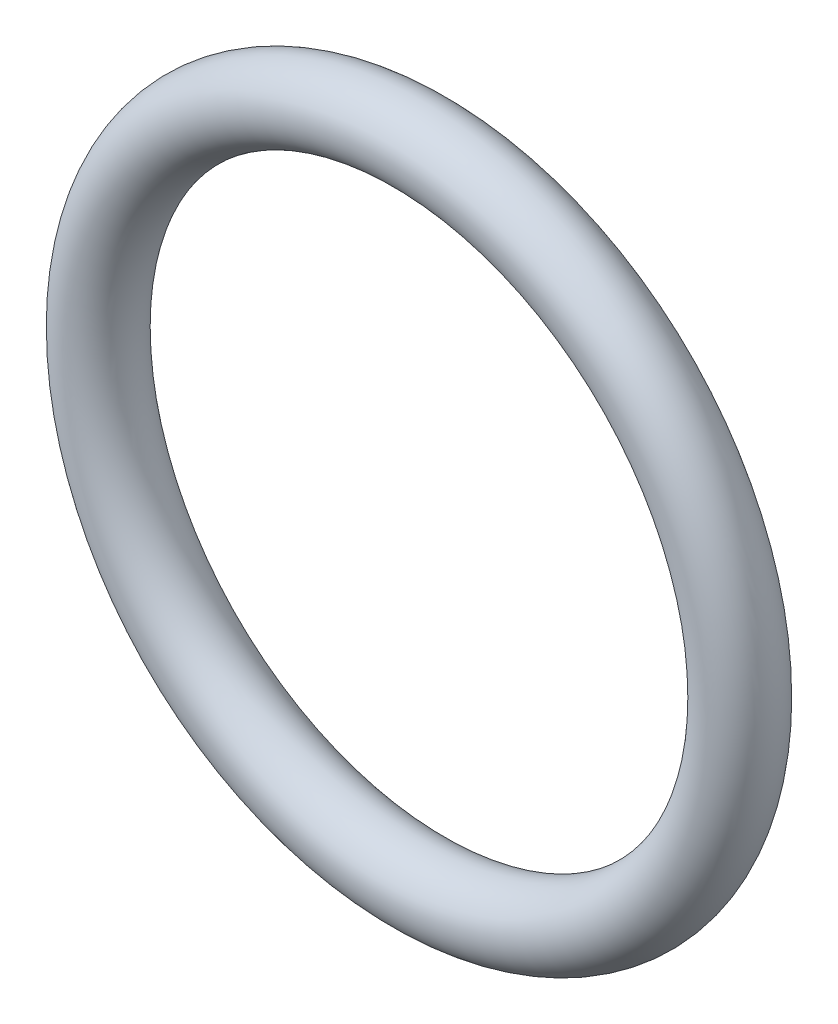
ISO-10303-21;
HEADER;
FILE_DESCRIPTION(('STEP AP214'),'2;1');
FILE_NAME('part.step','',(''),(''),'','','');
FILE_SCHEMA(('AUTOMOTIVE_DESIGN { 1 0 10303 214 1 1 1 1 }'));
ENDSEC;
DATA;
#1=APPLICATION_CONTEXT('core data for automotive mechanical design processes');
#2=APPLICATION_PROTOCOL_DEFINITION('international standard','automotive_design',2000,#1);
#3=PRODUCT_CONTEXT('',#1,'mechanical');
#4=PRODUCT('Part','Part','',(#3));
#5=PRODUCT_RELATED_PRODUCT_CATEGORY('part','',(#4));
#6=PRODUCT_DEFINITION_FORMATION('','',#4);
#7=PRODUCT_DEFINITION_CONTEXT('part definition',#1,'design');
#8=PRODUCT_DEFINITION('design','',#6,#7);
#9=PRODUCT_DEFINITION_SHAPE('','',#8);
#10=(LENGTH_UNIT() NAMED_UNIT(*) SI_UNIT(.MILLI.,.METRE.));
#11=(NAMED_UNIT(*) PLANE_ANGLE_UNIT() SI_UNIT($,.RADIAN.));
#12=(NAMED_UNIT(*) SI_UNIT($,.STERADIAN.) SOLID_ANGLE_UNIT());
#13=UNCERTAINTY_MEASURE_WITH_UNIT(LENGTH_MEASURE(1.E-05),#10,'distance_accuracy_value','');
#14=(GEOMETRIC_REPRESENTATION_CONTEXT(3) GLOBAL_UNCERTAINTY_ASSIGNED_CONTEXT((#13)) GLOBAL_UNIT_ASSIGNED_CONTEXT((#10,
#11,#12)) REPRESENTATION_CONTEXT('',''));
#15=CARTESIAN_POINT('',(0.,0.,0.));
#16=DIRECTION('',(0.,0.,1.));
#17=DIRECTION('',(1.,0.,0.));
#18=AXIS2_PLACEMENT_3D('',#15,#16,#17);
#19=CARTESIAN_POINT('',(0.,0.,0.));
#20=DIRECTION('',(0.,0.,1.));
#21=DIRECTION('',(1.,0.,0.));
#22=AXIS2_PLACEMENT_3D('',#19,#20,#21);
#23=TOROIDAL_SURFACE('',#22,22.7,2.6);
#24=CARTESIAN_POINT('',(25.3,0.,0.));
#25=VERTEX_POINT('',#24);
#26=VERTEX_LOOP('',#25);
#27=FACE_BOUND('',#26,.T.);
#28=ADVANCED_FACE('F33',(#27),#23,.T.);
#29=CLOSED_SHELL('',(#28));
#30=MANIFOLD_SOLID_BREP('B2',#29);
#31=ADVANCED_BREP_SHAPE_REPRESENTATION('',(#18,#30),#14);
#32=SHAPE_DEFINITION_REPRESENTATION(#9,#31);
ENDSEC;
END-ISO-10303-21;
